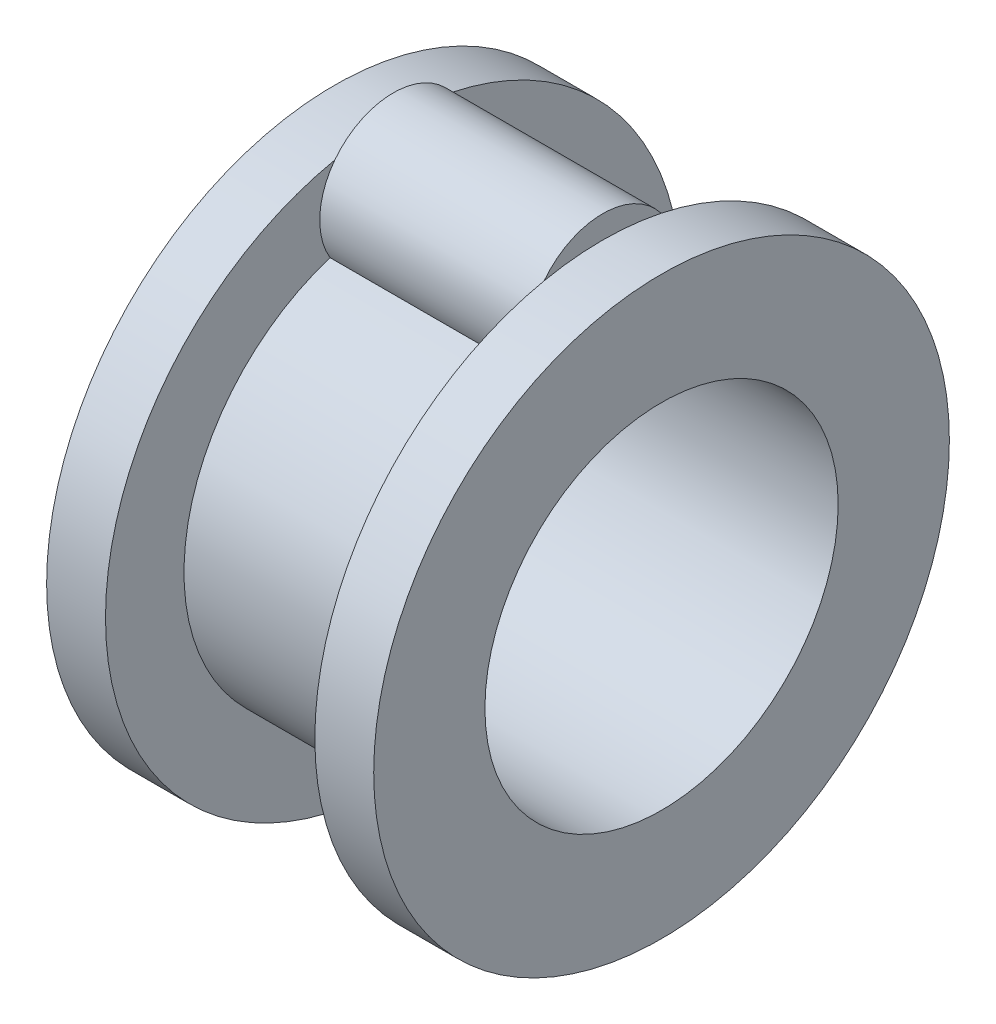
from build123d import *

# Parameters (mm, degrees)
ESQUISSE2_R        = 1.125
BOSS_EXTRU_1_DEPTH = 1.6


with BuildPart() as part:
    # Esquisse1 → Base-R_volution (revolve)
    with BuildSketch(Plane.XY, mode=Mode.PRIVATE) as base_r_volution_sk:
        Polygon((-2.5, 2.7), (-2.5, 4.4), (-1.6, 4.4), (-1.6, 3.2), (1.6, 3.2), (1.6, 4.4), (2.5, 4.4), (2.5, 2.7), align=None)
    revolve(base_r_volution_sk.sketch.rotate(Axis((-11.172756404, 0, 0), (1, 0, 0)), 90), axis=Axis((-11.172756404, 0, 0), (1, 0, 0)))

    # Esquisse2 → Boss.-Extru.1 (add, symmetric)
    with BuildSketch(Plane(origin=(0, 0, 0), x_dir=(0, 0, -1), z_dir=(1, 0, 0))):
        with Locations((0, 3.625)):
            Circle(ESQUISSE2_R)
    extrude(amount=BOSS_EXTRU_1_DEPTH, both=True)


solid = part.part
